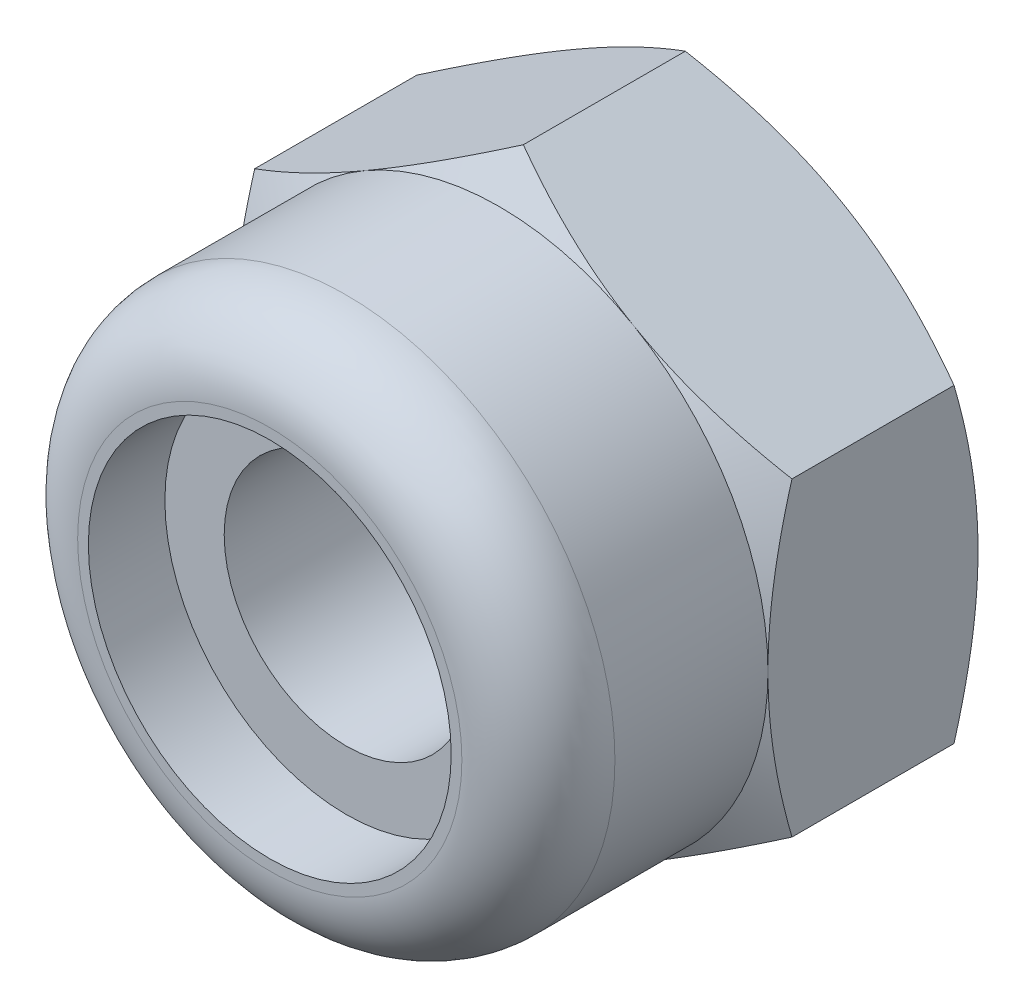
ISO-10303-21;
HEADER;
FILE_DESCRIPTION(('STEP AP214'),'2;1');
FILE_NAME('part.step','',(''),(''),'','','');
FILE_SCHEMA(('AUTOMOTIVE_DESIGN { 1 0 10303 214 1 1 1 1 }'));
ENDSEC;
DATA;
#1=APPLICATION_CONTEXT('core data for automotive mechanical design processes');
#2=APPLICATION_PROTOCOL_DEFINITION('international standard','automotive_design',2000,#1);
#3=PRODUCT_CONTEXT('',#1,'mechanical');
#4=PRODUCT('Part','Part','',(#3));
#5=PRODUCT_RELATED_PRODUCT_CATEGORY('part','',(#4));
#6=PRODUCT_DEFINITION_FORMATION('','',#4);
#7=PRODUCT_DEFINITION_CONTEXT('part definition',#1,'design');
#8=PRODUCT_DEFINITION('design','',#6,#7);
#9=PRODUCT_DEFINITION_SHAPE('','',#8);
#10=(LENGTH_UNIT() NAMED_UNIT(*) SI_UNIT(.MILLI.,.METRE.));
#11=(NAMED_UNIT(*) PLANE_ANGLE_UNIT() SI_UNIT($,.RADIAN.));
#12=(NAMED_UNIT(*) SI_UNIT($,.STERADIAN.) SOLID_ANGLE_UNIT());
#13=UNCERTAINTY_MEASURE_WITH_UNIT(LENGTH_MEASURE(1.E-05),#10,'distance_accuracy_value','');
#14=(GEOMETRIC_REPRESENTATION_CONTEXT(3) GLOBAL_UNCERTAINTY_ASSIGNED_CONTEXT((#13)) GLOBAL_UNIT_ASSIGNED_CONTEXT((#10,
#11,#12)) REPRESENTATION_CONTEXT('',''));
#15=CARTESIAN_POINT('',(0.,0.,0.));
#16=DIRECTION('',(0.,0.,1.));
#17=DIRECTION('',(1.,0.,0.));
#18=AXIS2_PLACEMENT_3D('',#15,#16,#17);
#19=CARTESIAN_POINT('',(0.,0.,-2.15));
#20=DIRECTION('',(0.,0.,1.));
#21=DIRECTION('',(1.,0.,0.));
#22=AXIS2_PLACEMENT_3D('',#19,#20,#21);
#23=CYLINDRICAL_SURFACE('',#22,1.25);
#24=CARTESIAN_POINT('',(0.,0.,1.56666666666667));
#25=DIRECTION('',(0.,0.,1.));
#26=DIRECTION('',(1.,0.,0.));
#27=AXIS2_PLACEMENT_3D('',#24,#25,#26);
#28=CIRCLE('',#27,1.25);
#29=CARTESIAN_POINT('',(1.25,0.,1.56666666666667));
#30=VERTEX_POINT('',#29);
#31=EDGE_CURVE('E281',#30,#30,#28,.T.);
#32=CARTESIAN_POINT('',(0.,0.,-1.94954811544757));
#33=DIRECTION('',(0.,0.,-1.));
#34=DIRECTION('',(-1.,0.,0.));
#35=AXIS2_PLACEMENT_3D('',#32,#33,#34);
#36=CIRCLE('',#35,1.25);
#37=CARTESIAN_POINT('',(1.25,0.,-1.94954811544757));
#38=VERTEX_POINT('',#37);
#39=EDGE_CURVE('E40',#38,#38,#36,.F.);
#40=CARTESIAN_POINT('',(1.25,0.,1.56666666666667));
#41=CARTESIAN_POINT('',(1.25,0.,1.53003942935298));
#42=CARTESIAN_POINT('',(1.25,0.,1.49341219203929));
#43=CARTESIAN_POINT('',(1.25,0.,1.42015771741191));
#44=CARTESIAN_POINT('',(1.25,0.,1.38353048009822));
#45=CARTESIAN_POINT('',(1.25,0.,1.31027600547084));
#46=CARTESIAN_POINT('',(1.25,0.,1.27364876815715));
#47=CARTESIAN_POINT('',(1.25,0.,1.20039429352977));
#48=CARTESIAN_POINT('',(1.25,0.,1.16376705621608));
#49=CARTESIAN_POINT('',(1.25,0.,1.0905125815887));
#50=CARTESIAN_POINT('',(1.25,0.,1.05388534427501));
#51=CARTESIAN_POINT('',(1.25,0.,0.980630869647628));
#52=CARTESIAN_POINT('',(1.25,0.,0.944003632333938));
#53=CARTESIAN_POINT('',(1.25,0.,0.870749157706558));
#54=CARTESIAN_POINT('',(1.25,0.,0.834121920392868));
#55=CARTESIAN_POINT('',(1.25,0.,0.760867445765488));
#56=CARTESIAN_POINT('',(1.25,0.,0.724240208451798));
#57=CARTESIAN_POINT('',(1.25,0.,0.650985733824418));
#58=CARTESIAN_POINT('',(1.25,0.,0.614358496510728));
#59=CARTESIAN_POINT('',(1.25,0.,0.541104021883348));
#60=CARTESIAN_POINT('',(1.25,0.,0.504476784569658));
#61=CARTESIAN_POINT('',(1.25,0.,0.431222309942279));
#62=CARTESIAN_POINT('',(1.25,0.,0.394595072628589));
#63=CARTESIAN_POINT('',(1.25,0.,0.321340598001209));
#64=CARTESIAN_POINT('',(1.25,0.,0.284713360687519));
#65=CARTESIAN_POINT('',(1.25,0.,0.211458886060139));
#66=CARTESIAN_POINT('',(1.25,0.,0.174831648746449));
#67=CARTESIAN_POINT('',(1.25,0.,0.101577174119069));
#68=CARTESIAN_POINT('',(1.25,0.,0.064949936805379));
#69=CARTESIAN_POINT('',(1.25,0.,-0.00830453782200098));
#70=CARTESIAN_POINT('',(1.25,0.,-0.0449317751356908));
#71=CARTESIAN_POINT('',(1.25,0.,-0.118186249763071));
#72=CARTESIAN_POINT('',(1.25,0.,-0.154813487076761));
#73=CARTESIAN_POINT('',(1.25,0.,-0.228067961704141));
#74=CARTESIAN_POINT('',(1.25,0.,-0.26469519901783));
#75=CARTESIAN_POINT('',(1.25,0.,-0.33794967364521));
#76=CARTESIAN_POINT('',(1.25,0.,-0.3745769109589));
#77=CARTESIAN_POINT('',(1.25,0.,-0.44783138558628));
#78=CARTESIAN_POINT('',(1.25,0.,-0.48445862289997));
#79=CARTESIAN_POINT('',(1.25,0.,-0.55771309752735));
#80=CARTESIAN_POINT('',(1.25,0.,-0.59434033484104));
#81=CARTESIAN_POINT('',(1.25,0.,-0.66759480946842));
#82=CARTESIAN_POINT('',(1.25,0.,-0.70422204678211));
#83=CARTESIAN_POINT('',(1.25,0.,-0.77747652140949));
#84=CARTESIAN_POINT('',(1.25,0.,-0.81410375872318));
#85=CARTESIAN_POINT('',(1.25,0.,-0.88735823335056));
#86=CARTESIAN_POINT('',(1.25,0.,-0.92398547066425));
#87=CARTESIAN_POINT('',(1.25,0.,-0.99723994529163));
#88=CARTESIAN_POINT('',(1.25,0.,-1.03386718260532));
#89=CARTESIAN_POINT('',(1.25,0.,-1.1071216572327));
#90=CARTESIAN_POINT('',(1.25,0.,-1.14374889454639));
#91=CARTESIAN_POINT('',(1.25,0.,-1.21700336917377));
#92=CARTESIAN_POINT('',(1.25,0.,-1.25363060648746));
#93=CARTESIAN_POINT('',(1.25,0.,-1.32688508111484));
#94=CARTESIAN_POINT('',(1.25,0.,-1.36351231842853));
#95=CARTESIAN_POINT('',(1.25,0.,-1.43676679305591));
#96=CARTESIAN_POINT('',(1.25,0.,-1.4733940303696));
#97=CARTESIAN_POINT('',(1.25,0.,-1.54664850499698));
#98=CARTESIAN_POINT('',(1.25,0.,-1.58327574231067));
#99=CARTESIAN_POINT('',(1.25,0.,-1.65653021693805));
#100=CARTESIAN_POINT('',(1.25,0.,-1.69315745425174));
#101=CARTESIAN_POINT('',(1.25,0.,-1.76641192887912));
#102=CARTESIAN_POINT('',(1.25,0.,-1.80303916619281));
#103=CARTESIAN_POINT('',(1.25,0.,-1.87629364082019));
#104=CARTESIAN_POINT('',(1.25,0.,-1.91292087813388));
#105=CARTESIAN_POINT('',(1.25,0.,-1.94954811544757));
#106=B_SPLINE_CURVE_WITH_KNOTS('',3,(#40,#41,#42,#43,#44,#45,#46,#47,#48,#49,#50,#51,#52,#53,
#54,#55,#56,#57,#58,#59,#60,#61,#62,#63,#64,#65,#66,#67,#68,#69,#70,#71,#72,#73,#74,#75,#76,#77,
#78,#79,#80,#81,#82,#83,#84,#85,#86,#87,#88,#89,#90,#91,#92,#93,#94,#95,#96,#97,#98,#99,#100,
#101,#102,#103,#104,#105),.UNSPECIFIED.,.F.,.F.,(4,2,2,2,2,2,2,2,2,2,2,2,2,2,2,2,2,2,2,2,2,2,2,
2,2,2,2,2,2,2,2,2,4),(0.,0.10988171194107,0.21976342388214,0.329645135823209,0.439526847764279,
0.549408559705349,0.659290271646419,0.769171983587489,0.879053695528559,0.988935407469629,
1.0988171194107,1.20869883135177,1.31858054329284,1.42846225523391,1.53834396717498,
1.64822567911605,1.75810739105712,1.86798910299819,1.97787081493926,2.08775252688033,
2.1976342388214,2.30751595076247,2.41739766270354,2.52727937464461,2.63716108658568,
2.74704279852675,2.85692451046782,2.96680622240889,3.07668793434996,3.18656964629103,
3.29645135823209,3.40633307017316,3.51621478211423),.UNSPECIFIED.);
#107=EDGE_CURVE('BSEAM35',#30,#38,#106,.T.);
#108=ORIENTED_EDGE('',*,*,#31,.T.);
#109=ORIENTED_EDGE('',*,*,#39,.F.);
#110=ORIENTED_EDGE('',*,*,#107,.T.);
#111=ORIENTED_EDGE('',*,*,#107,.F.);
#112=EDGE_LOOP('',(#108,#110,#109,#111));
#113=FACE_BOUND('',#112,.T.);
#114=ADVANCED_FACE('F35',(#113),#23,.F.);
#115=CARTESIAN_POINT('',(0.,3.17542648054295,-2.15));
#116=DIRECTION('',(-0.500000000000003,0.866025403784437,0.));
#117=DIRECTION('',(-0.866025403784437,-0.500000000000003,0.));
#118=AXIS2_PLACEMENT_3D('',#115,#116,#117);
#119=PLANE('',#118);
#120=DIRECTION('',(0.,0.,1.));
#121=VECTOR('',#120,1.);
#122=CARTESIAN_POINT('',(-2.75,1.58771324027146,-2.15));
#123=LINE('',#122,#121);
#124=CARTESIAN_POINT('',(-2.75,1.58771324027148,-1.90437990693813));
#125=VERTEX_POINT('',#124);
#126=CARTESIAN_POINT('',(-2.75,1.58771324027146,-0.245620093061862));
#127=VERTEX_POINT('',#126);
#128=EDGE_CURVE('E254',#125,#127,#123,.T.);
#129=ORIENTED_EDGE('',*,*,#128,.T.);
#130=CARTESIAN_POINT('',(-2.7502,1.58759777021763,-0.24568676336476));
#131=CARTESIAN_POINT('',(-2.62935077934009,1.65737010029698,-0.205387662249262));
#132=CARTESIAN_POINT('',(-2.50745839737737,1.72774469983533,-0.168736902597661));
#133=CARTESIAN_POINT('',(-2.26156287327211,1.86971254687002,-0.1047621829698));
#134=CARTESIAN_POINT('',(-2.13755536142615,1.94130831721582,-0.0774608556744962));
#135=CARTESIAN_POINT('',(-1.89107720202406,2.08361254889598,-0.0349617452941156));
#136=CARTESIAN_POINT('',(-1.76864448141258,2.15429911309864,-0.0194811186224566));
#137=CARTESIAN_POINT('',(-1.52320285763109,2.29600490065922,-0.00099939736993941));
#138=CARTESIAN_POINT('',(-1.40019484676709,2.36702360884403,0.0020170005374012));
#139=CARTESIAN_POINT('',(-1.17034121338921,2.49972966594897,-0.00425314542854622));
#140=CARTESIAN_POINT('',(-1.06346120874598,2.56143686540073,-0.0120001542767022));
#141=CARTESIAN_POINT('',(-0.850397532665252,2.68444923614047,-0.0365551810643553));
#142=CARTESIAN_POINT('',(-0.744214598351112,2.74575398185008,-0.0533715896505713));
#143=CARTESIAN_POINT('',(-0.530711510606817,2.86902004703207,-0.0954119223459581));
#144=CARTESIAN_POINT('',(-0.423418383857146,2.93096576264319,-0.120814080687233));
#145=CARTESIAN_POINT('',(-0.210432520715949,3.05393320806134,-0.178467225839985));
#146=CARTESIAN_POINT('',(-0.104737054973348,3.11495651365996,-0.210704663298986));
#147=CARTESIAN_POINT('',(0.000200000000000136,3.17554195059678,-0.245686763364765));
#148=B_SPLINE_CURVE_WITH_KNOTS('',3,(#130,#131,#132,#133,#134,#135,#136,#137,#138,#139,#140,
#141,#142,#143,#144,#145,#146,#147),.UNSPECIFIED.,.F.,.F.,(4,2,2,2,2,2,2,2,4),(0.,
0.435912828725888,0.872873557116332,1.29901931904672,1.72464171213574,2.09526089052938,
2.46622354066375,2.84541551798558,3.22386274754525),.UNSPECIFIED.);
#149=CARTESIAN_POINT('',(-1.37500000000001,2.3815698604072,0.));
#150=VERTEX_POINT('',#149);
#151=EDGE_CURVE('E60',#127,#150,#148,.T.);
#152=ORIENTED_EDGE('',*,*,#151,.T.);
#153=CARTESIAN_POINT('',(0.,3.17542648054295,-0.245620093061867));
#154=VERTEX_POINT('',#153);
#155=EDGE_CURVE('E203',#150,#154,#148,.T.);
#156=ORIENTED_EDGE('',*,*,#155,.T.);
#157=DIRECTION('',(0.,0.,1.));
#158=VECTOR('',#157,1.);
#159=CARTESIAN_POINT('',(0.,3.17542648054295,-2.15));
#160=LINE('',#159,#158);
#161=CARTESIAN_POINT('',(0.,3.17542648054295,-1.90437990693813));
#162=VERTEX_POINT('',#161);
#163=EDGE_CURVE('E240',#162,#154,#160,.T.);
#164=ORIENTED_EDGE('',*,*,#163,.F.);
#165=CARTESIAN_POINT('',(-2.7502,1.58759777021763,-1.90431323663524));
#166=CARTESIAN_POINT('',(-2.62935077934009,1.65737010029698,-1.94461233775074));
#167=CARTESIAN_POINT('',(-2.50745839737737,1.72774469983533,-1.98126309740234));
#168=CARTESIAN_POINT('',(-2.26156287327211,1.86971254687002,-2.0452378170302));
#169=CARTESIAN_POINT('',(-2.13755536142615,1.94130831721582,-2.0725391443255));
#170=CARTESIAN_POINT('',(-1.89107720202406,2.08361254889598,-2.11503825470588));
#171=CARTESIAN_POINT('',(-1.76864448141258,2.15429911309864,-2.13051888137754));
#172=CARTESIAN_POINT('',(-1.52320285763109,2.29600490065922,-2.14900060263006));
#173=CARTESIAN_POINT('',(-1.40019484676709,2.36702360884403,-2.1520170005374));
#174=CARTESIAN_POINT('',(-1.17034121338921,2.49972966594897,-2.14574685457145));
#175=CARTESIAN_POINT('',(-1.06346120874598,2.56143686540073,-2.1379998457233));
#176=CARTESIAN_POINT('',(-0.850397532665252,2.68444923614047,-2.11344481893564));
#177=CARTESIAN_POINT('',(-0.744214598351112,2.74575398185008,-2.09662841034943));
#178=CARTESIAN_POINT('',(-0.530711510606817,2.86902004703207,-2.05458807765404));
#179=CARTESIAN_POINT('',(-0.423418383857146,2.93096576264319,-2.02918591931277));
#180=CARTESIAN_POINT('',(-0.210432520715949,3.05393320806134,-1.97153277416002));
#181=CARTESIAN_POINT('',(-0.104737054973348,3.11495651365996,-1.93929533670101));
#182=CARTESIAN_POINT('',(0.000200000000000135,3.17554195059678,-1.90431323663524));
#183=B_SPLINE_CURVE_WITH_KNOTS('',3,(#165,#166,#167,#168,#169,#170,#171,#172,#173,#174,#175,
#176,#177,#178,#179,#180,#181,#182),.UNSPECIFIED.,.F.,.F.,(4,2,2,2,2,2,2,2,4),(0.,
0.435912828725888,0.872873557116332,1.29901931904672,1.72464171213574,2.09526089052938,
2.46622354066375,2.84541551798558,3.22386274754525),.UNSPECIFIED.);
#184=CARTESIAN_POINT('',(-1.37500000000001,2.3815698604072,-2.15));
#185=VERTEX_POINT('',#184);
#186=EDGE_CURVE('E256',#185,#162,#183,.T.);
#187=ORIENTED_EDGE('',*,*,#186,.F.);
#188=EDGE_CURVE('E234',#125,#185,#183,.T.);
#189=ORIENTED_EDGE('',*,*,#188,.F.);
#190=EDGE_LOOP('',(#129,#152,#156,#164,#187,#189));
#191=FACE_BOUND('',#190,.T.);
#192=ADVANCED_FACE('F37',(#191),#119,.T.);
#193=CARTESIAN_POINT('',(2.75,1.58771324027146,-2.15));
#194=DIRECTION('',(0.500000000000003,0.866025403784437,0.));
#195=DIRECTION('',(-0.866025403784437,0.500000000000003,0.));
#196=AXIS2_PLACEMENT_3D('',#193,#194,#195);
#197=PLANE('',#196);
#198=ORIENTED_EDGE('',*,*,#163,.T.);
#199=CARTESIAN_POINT('',(-0.000199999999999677,3.17554195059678,-0.245686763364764));
#200=CARTESIAN_POINT('',(0.120649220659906,3.10576962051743,-0.205387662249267));
#201=CARTESIAN_POINT('',(0.242541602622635,3.03539502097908,-0.168736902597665));
#202=CARTESIAN_POINT('',(0.488437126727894,2.89342717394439,-0.104762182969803));
#203=CARTESIAN_POINT('',(0.612444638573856,2.82183140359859,-0.0774608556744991));
#204=CARTESIAN_POINT('',(0.858922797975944,2.67952717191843,-0.0349617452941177));
#205=CARTESIAN_POINT('',(0.981355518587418,2.60884060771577,-0.0194811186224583));
#206=CARTESIAN_POINT('',(1.22679714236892,2.46713482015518,-0.00099939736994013));
#207=CARTESIAN_POINT('',(1.34980515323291,2.39611611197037,0.00201700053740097));
#208=CARTESIAN_POINT('',(1.57965878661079,2.26341005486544,-0.00425314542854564));
#209=CARTESIAN_POINT('',(1.68653879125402,2.20170285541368,-0.0120001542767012));
#210=CARTESIAN_POINT('',(1.89960246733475,2.07869048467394,-0.0365551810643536));
#211=CARTESIAN_POINT('',(2.00578540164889,2.01738573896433,-0.0533715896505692));
#212=CARTESIAN_POINT('',(2.21928848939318,1.89411967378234,-0.0954119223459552));
#213=CARTESIAN_POINT('',(2.32658161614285,1.83217395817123,-0.12081408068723));
#214=CARTESIAN_POINT('',(2.53956747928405,1.70920651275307,-0.178467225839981));
#215=CARTESIAN_POINT('',(2.64526294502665,1.64818320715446,-0.210704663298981));
#216=CARTESIAN_POINT('',(2.7502,1.58759777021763,-0.245686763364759));
#217=B_SPLINE_CURVE_WITH_KNOTS('',3,(#199,#200,#201,#202,#203,#204,#205,#206,#207,#208,#209,
#210,#211,#212,#213,#214,#215,#216),.UNSPECIFIED.,.F.,.F.,(4,2,2,2,2,2,2,2,4),(0.,
0.43591282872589,0.872873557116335,1.29901931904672,1.72464171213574,2.09526089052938,
2.46622354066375,2.84541551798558,3.22386274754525),.UNSPECIFIED.);
#218=CARTESIAN_POINT('',(1.37500000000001,2.3815698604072,0.));
#219=VERTEX_POINT('',#218);
#220=EDGE_CURVE('E212',#154,#219,#217,.T.);
#221=ORIENTED_EDGE('',*,*,#220,.T.);
#222=CARTESIAN_POINT('',(2.75,1.58771324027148,-0.245620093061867));
#223=VERTEX_POINT('',#222);
#224=EDGE_CURVE('E204',#219,#223,#217,.T.);
#225=ORIENTED_EDGE('',*,*,#224,.T.);
#226=DIRECTION('',(0.,0.,1.));
#227=VECTOR('',#226,1.);
#228=CARTESIAN_POINT('',(2.75,1.58771324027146,-2.15));
#229=LINE('',#228,#227);
#230=CARTESIAN_POINT('',(2.75,1.58771324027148,-1.90437990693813));
#231=VERTEX_POINT('',#230);
#232=EDGE_CURVE('E244',#231,#223,#229,.T.);
#233=ORIENTED_EDGE('',*,*,#232,.F.);
#234=CARTESIAN_POINT('',(-0.000199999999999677,3.17554195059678,-1.90431323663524));
#235=CARTESIAN_POINT('',(0.120649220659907,3.10576962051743,-1.94461233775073));
#236=CARTESIAN_POINT('',(0.242541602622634,3.03539502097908,-1.98126309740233));
#237=CARTESIAN_POINT('',(0.488437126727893,2.89342717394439,-2.0452378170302));
#238=CARTESIAN_POINT('',(0.612444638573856,2.82183140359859,-2.0725391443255));
#239=CARTESIAN_POINT('',(0.858922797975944,2.67952717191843,-2.11503825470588));
#240=CARTESIAN_POINT('',(0.981355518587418,2.60884060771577,-2.13051888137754));
#241=CARTESIAN_POINT('',(1.22679714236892,2.46713482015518,-2.14900060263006));
#242=CARTESIAN_POINT('',(1.34980515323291,2.39611611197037,-2.1520170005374));
#243=CARTESIAN_POINT('',(1.57965878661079,2.26341005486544,-2.14574685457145));
#244=CARTESIAN_POINT('',(1.68653879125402,2.20170285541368,-2.1379998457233));
#245=CARTESIAN_POINT('',(1.89960246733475,2.07869048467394,-2.11344481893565));
#246=CARTESIAN_POINT('',(2.00578540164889,2.01738573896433,-2.09662841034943));
#247=CARTESIAN_POINT('',(2.21928848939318,1.89411967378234,-2.05458807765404));
#248=CARTESIAN_POINT('',(2.32658161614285,1.83217395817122,-2.02918591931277));
#249=CARTESIAN_POINT('',(2.53956747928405,1.70920651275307,-1.97153277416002));
#250=CARTESIAN_POINT('',(2.64526294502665,1.64818320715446,-1.93929533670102));
#251=CARTESIAN_POINT('',(2.7502,1.58759777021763,-1.90431323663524));
#252=B_SPLINE_CURVE_WITH_KNOTS('',3,(#234,#235,#236,#237,#238,#239,#240,#241,#242,#243,#244,
#245,#246,#247,#248,#249,#250,#251),.UNSPECIFIED.,.F.,.F.,(4,2,2,2,2,2,2,2,4),(0.,
0.43591282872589,0.872873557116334,1.29901931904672,1.72464171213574,2.09526089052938,
2.46622354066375,2.84541551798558,3.22386274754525),.UNSPECIFIED.);
#253=CARTESIAN_POINT('',(1.37500000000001,2.3815698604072,-2.15));
#254=VERTEX_POINT('',#253);
#255=EDGE_CURVE('E225',#254,#231,#252,.T.);
#256=ORIENTED_EDGE('',*,*,#255,.F.);
#257=EDGE_CURVE('E232',#162,#254,#252,.T.);
#258=ORIENTED_EDGE('',*,*,#257,.F.);
#259=EDGE_LOOP('',(#198,#221,#225,#233,#256,#258));
#260=FACE_BOUND('',#259,.T.);
#261=ADVANCED_FACE('F215',(#260),#197,.T.);
#262=CARTESIAN_POINT('',(2.75,1.58771324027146,-2.15));
#263=DIRECTION('',(-1.,0.,0.));
#264=DIRECTION('',(0.,0.,1.));
#265=AXIS2_PLACEMENT_3D('',#262,#263,#264);
#266=PLANE('',#265);
#267=CARTESIAN_POINT('',(2.75,-4.21084949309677,-1.31594843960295));
#268=CARTESIAN_POINT('',(2.75,-4.09010894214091,-1.25759993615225));
#269=CARTESIAN_POINT('',(2.75,-3.9690829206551,-1.19983146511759));
#270=CARTESIAN_POINT('',(2.75,-3.72630558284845,-1.08578603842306));
#271=CARTESIAN_POINT('',(2.75,-3.60455414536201,-1.02950934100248));
#272=CARTESIAN_POINT('',(2.75,-3.35951393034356,-0.918482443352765));
#273=CARTESIAN_POINT('',(2.75,-3.23622034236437,-0.863742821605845));
#274=CARTESIAN_POINT('',(2.75,-2.98861980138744,-0.756614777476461));
#275=CARTESIAN_POINT('',(2.75,-2.86431290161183,-0.70422623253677));
#276=CARTESIAN_POINT('',(2.75,-2.61294485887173,-0.601803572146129));
#277=CARTESIAN_POINT('',(2.75,-2.48586863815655,-0.551806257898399));
#278=CARTESIAN_POINT('',(2.75,-2.23021732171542,-0.455727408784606));
#279=CARTESIAN_POINT('',(2.75,-2.10164206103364,-0.409646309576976));
#280=CARTESIAN_POINT('',(2.75,-1.84305218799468,-0.322638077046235));
#281=CARTESIAN_POINT('',(2.75,-1.71304130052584,-0.281699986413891));
#282=CARTESIAN_POINT('',(2.75,-1.45117125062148,-0.206307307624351));
#283=CARTESIAN_POINT('',(2.75,-1.31931268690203,-0.171850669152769));
#284=CARTESIAN_POINT('',(2.75,-1.05365722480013,-0.111093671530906));
#285=CARTESIAN_POINT('',(2.75,-0.919859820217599,-0.0847954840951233));
#286=CARTESIAN_POINT('',(2.75,-0.650651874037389,-0.0421260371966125));
#287=CARTESIAN_POINT('',(2.75,-0.515241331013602,-0.0257547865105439));
#288=CARTESIAN_POINT('',(2.75,-0.244373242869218,-0.00438749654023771));
#289=CARTESIAN_POINT('',(2.75,-0.10892152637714,0.000680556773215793));
#290=CARTESIAN_POINT('',(2.75,0.161887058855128,-0.000827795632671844));
#291=CARTESIAN_POINT('',(2.75,0.297243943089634,-0.00740117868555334));
#292=CARTESIAN_POINT('',(2.75,0.528385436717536,-0.0281041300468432));
#293=CARTESIAN_POINT('',(2.75,0.624425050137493,-0.0395376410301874));
#294=CARTESIAN_POINT('',(2.75,0.815762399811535,-0.0675217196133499));
#295=CARTESIAN_POINT('',(2.75,0.911060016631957,-0.084073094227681));
#296=CARTESIAN_POINT('',(2.75,1.19576218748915,-0.140535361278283));
#297=CARTESIAN_POINT('',(2.75,1.38383224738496,-0.187239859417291));
#298=CARTESIAN_POINT('',(2.75,1.66525048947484,-0.267792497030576));
#299=CARTESIAN_POINT('',(2.75,1.76006556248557,-0.296803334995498));
#300=CARTESIAN_POINT('',(2.75,1.94870609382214,-0.357695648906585));
#301=CARTESIAN_POINT('',(2.75,2.04253218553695,-0.3895751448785));
#302=CARTESIAN_POINT('',(2.75,2.22880240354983,-0.455541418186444));
#303=CARTESIAN_POINT('',(2.75,2.3212513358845,-0.489614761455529));
#304=CARTESIAN_POINT('',(2.75,2.50543192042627,-0.559761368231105));
#305=CARTESIAN_POINT('',(2.75,2.59716326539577,-0.595835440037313));
#306=CARTESIAN_POINT('',(2.75,2.68856293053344,-0.632712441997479));
#307=B_SPLINE_CURVE_WITH_KNOTS('',3,(#267,#268,#269,#270,#271,#272,#273,#274,#275,#276,#277,
#278,#279,#280,#281,#282,#283,#284,#285,#286,#287,#288,#289,#290,#291,#292,#293,#294,#295,#296,
#297,#298,#299,#300,#301,#302,#303,#304,#305,#306),.UNSPECIFIED.,.F.,.F.,(4,2,2,2,2,2,2,2,2,2,2,
2,2,2,2,2,2,2,2,4),(0.,0.402305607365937,0.804680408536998,1.20935783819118,1.61401414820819,
2.0236383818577,2.43330812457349,2.84208969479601,3.25074173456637,3.65950246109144,
4.06826354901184,4.47441284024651,4.88045669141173,5.17046846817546,5.46052599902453,
6.04107275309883,6.33851131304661,6.63574613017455,6.93130791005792,7.22698998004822),.UNSPECIFIED.);
#308=CARTESIAN_POINT('',(2.75,-1.58771324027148,-0.245620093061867));
#309=VERTEX_POINT('',#308);
#310=CARTESIAN_POINT('',(2.75,0.,0.));
#311=VERTEX_POINT('',#310);
#312=EDGE_CURVE('E191',#309,#311,#307,.T.);
#313=ORIENTED_EDGE('',*,*,#312,.F.);
#314=DIRECTION('',(0.,0.,1.));
#315=VECTOR('',#314,1.);
#316=CARTESIAN_POINT('',(2.75,-1.58771324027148,-2.15));
#317=LINE('',#316,#315);
#318=CARTESIAN_POINT('',(2.75,-1.58771324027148,-1.90437990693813));
#319=VERTEX_POINT('',#318);
#320=EDGE_CURVE('E247',#319,#309,#317,.T.);
#321=ORIENTED_EDGE('',*,*,#320,.F.);
#322=CARTESIAN_POINT('',(2.75,-4.21084949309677,-0.834051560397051));
#323=CARTESIAN_POINT('',(2.75,-4.09010894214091,-0.892400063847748));
#324=CARTESIAN_POINT('',(2.75,-3.9690829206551,-0.950168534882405));
#325=CARTESIAN_POINT('',(2.75,-3.72630558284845,-1.06421396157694));
#326=CARTESIAN_POINT('',(2.75,-3.60455414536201,-1.12049065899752));
#327=CARTESIAN_POINT('',(2.75,-3.35951393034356,-1.23151755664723));
#328=CARTESIAN_POINT('',(2.75,-3.23622034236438,-1.28625717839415));
#329=CARTESIAN_POINT('',(2.75,-2.98861980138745,-1.39338522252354));
#330=CARTESIAN_POINT('',(2.75,-2.86431290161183,-1.44577376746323));
#331=CARTESIAN_POINT('',(2.75,-2.61294485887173,-1.54819642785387));
#332=CARTESIAN_POINT('',(2.75,-2.48586863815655,-1.5981937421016));
#333=CARTESIAN_POINT('',(2.75,-2.23021732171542,-1.69427259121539));
#334=CARTESIAN_POINT('',(2.75,-2.10164206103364,-1.74035369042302));
#335=CARTESIAN_POINT('',(2.75,-1.84305218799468,-1.82736192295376));
#336=CARTESIAN_POINT('',(2.75,-1.71304130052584,-1.86830001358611));
#337=CARTESIAN_POINT('',(2.75,-1.45117125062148,-1.94369269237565));
#338=CARTESIAN_POINT('',(2.75,-1.31931268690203,-1.97814933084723));
#339=CARTESIAN_POINT('',(2.75,-1.05365722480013,-2.03890632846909));
#340=CARTESIAN_POINT('',(2.75,-0.919859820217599,-2.06520451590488));
#341=CARTESIAN_POINT('',(2.75,-0.650651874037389,-2.10787396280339));
#342=CARTESIAN_POINT('',(2.75,-0.515241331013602,-2.12424521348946));
#343=CARTESIAN_POINT('',(2.75,-0.244373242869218,-2.14561250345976));
#344=CARTESIAN_POINT('',(2.75,-0.10892152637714,-2.15068055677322));
#345=CARTESIAN_POINT('',(2.75,0.161887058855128,-2.14917220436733));
#346=CARTESIAN_POINT('',(2.75,0.297243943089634,-2.14259882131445));
#347=CARTESIAN_POINT('',(2.75,0.528385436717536,-2.12189586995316));
#348=CARTESIAN_POINT('',(2.75,0.624425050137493,-2.11046235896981));
#349=CARTESIAN_POINT('',(2.75,0.815762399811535,-2.08247828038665));
#350=CARTESIAN_POINT('',(2.75,0.911060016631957,-2.06592690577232));
#351=CARTESIAN_POINT('',(2.75,1.19576218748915,-2.00946463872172));
#352=CARTESIAN_POINT('',(2.75,1.38383224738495,-1.96276014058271));
#353=CARTESIAN_POINT('',(2.75,1.66525048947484,-1.88220750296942));
#354=CARTESIAN_POINT('',(2.75,1.76006556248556,-1.8531966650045));
#355=CARTESIAN_POINT('',(2.75,1.94870609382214,-1.79230435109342));
#356=CARTESIAN_POINT('',(2.75,2.04253218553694,-1.7604248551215));
#357=CARTESIAN_POINT('',(2.75,2.22880240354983,-1.69445858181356));
#358=CARTESIAN_POINT('',(2.75,2.3212513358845,-1.66038523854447));
#359=CARTESIAN_POINT('',(2.75,2.50543192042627,-1.5902386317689));
#360=CARTESIAN_POINT('',(2.75,2.59716326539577,-1.55416455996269));
#361=CARTESIAN_POINT('',(2.75,2.68856293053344,-1.51728755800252));
#362=B_SPLINE_CURVE_WITH_KNOTS('',3,(#322,#323,#324,#325,#326,#327,#328,#329,#330,#331,#332,
#333,#334,#335,#336,#337,#338,#339,#340,#341,#342,#343,#344,#345,#346,#347,#348,#349,#350,#351,
#352,#353,#354,#355,#356,#357,#358,#359,#360,#361),.UNSPECIFIED.,.F.,.F.,(4,2,2,2,2,2,2,2,2,2,2,
2,2,2,2,2,2,2,2,4),(0.,0.402305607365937,0.804680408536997,1.20935783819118,1.61401414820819,
2.0236383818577,2.43330812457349,2.84208969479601,3.25074173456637,3.65950246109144,
4.06826354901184,4.47441284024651,4.88045669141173,5.17046846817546,5.46052599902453,
6.04107275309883,6.33851131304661,6.63574613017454,6.93130791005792,7.22698998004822),.UNSPECIFIED.);
#363=CARTESIAN_POINT('',(2.75,0.,-2.15));
#364=VERTEX_POINT('',#363);
#365=EDGE_CURVE('E372',#319,#364,#362,.T.);
#366=ORIENTED_EDGE('',*,*,#365,.T.);
#367=EDGE_CURVE('E233',#364,#231,#362,.T.);
#368=ORIENTED_EDGE('',*,*,#367,.T.);
#369=ORIENTED_EDGE('',*,*,#232,.T.);
#370=EDGE_CURVE('E202',#311,#223,#307,.T.);
#371=ORIENTED_EDGE('',*,*,#370,.F.);
#372=EDGE_LOOP('',(#313,#321,#366,#368,#369,#371));
#373=FACE_BOUND('',#372,.T.);
#374=ADVANCED_FACE('F219',(#373),#266,.F.);
#375=CARTESIAN_POINT('',(0.,-3.17542648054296,-2.15));
#376=DIRECTION('',(0.500000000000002,-0.866025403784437,0.));
#377=DIRECTION('',(0.866025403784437,0.500000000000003,0.));
#378=AXIS2_PLACEMENT_3D('',#375,#376,#377);
#379=PLANE('',#378);
#380=ORIENTED_EDGE('',*,*,#320,.T.);
#381=CARTESIAN_POINT('',(2.7502,-1.58759777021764,-0.245686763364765));
#382=CARTESIAN_POINT('',(2.62935077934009,-1.657370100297,-0.205387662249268));
#383=CARTESIAN_POINT('',(2.50745839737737,-1.72774469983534,-0.168736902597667));
#384=CARTESIAN_POINT('',(2.26156287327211,-1.86971254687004,-0.104762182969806));
#385=CARTESIAN_POINT('',(2.13755536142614,-1.94130831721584,-0.0774608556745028));
#386=CARTESIAN_POINT('',(1.89107720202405,-2.08361254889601,-0.034961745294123));
#387=CARTESIAN_POINT('',(1.76864448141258,-2.15429911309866,-0.0194811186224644));
#388=CARTESIAN_POINT('',(1.52320285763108,-2.29600490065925,-0.00099939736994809));
#389=CARTESIAN_POINT('',(1.40019484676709,-2.36702360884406,0.00201700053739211));
#390=CARTESIAN_POINT('',(1.1703412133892,-2.49972966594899,-0.00425314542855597));
#391=CARTESIAN_POINT('',(1.06346120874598,-2.56143686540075,-0.0120001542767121));
#392=CARTESIAN_POINT('',(0.850397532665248,-2.68444923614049,-0.0365551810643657));
#393=CARTESIAN_POINT('',(0.744214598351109,-2.7457539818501,-0.0533715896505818));
#394=CARTESIAN_POINT('',(0.530711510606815,-2.86902004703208,-0.0954119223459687));
#395=CARTESIAN_POINT('',(0.423418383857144,-2.9309657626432,-0.120814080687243));
#396=CARTESIAN_POINT('',(0.210432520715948,-3.05393320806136,-0.178467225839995));
#397=CARTESIAN_POINT('',(0.104737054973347,-3.11495651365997,-0.210704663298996));
#398=CARTESIAN_POINT('',(-0.000200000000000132,-3.1755419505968,-0.245686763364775));
#399=B_SPLINE_CURVE_WITH_KNOTS('',3,(#381,#382,#383,#384,#385,#386,#387,#388,#389,#390,#391,
#392,#393,#394,#395,#396,#397,#398),.UNSPECIFIED.,.F.,.F.,(4,2,2,2,2,2,2,2,4),(0.,
0.435912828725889,0.872873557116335,1.29901931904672,1.72464171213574,2.09526089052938,
2.46622354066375,2.84541551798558,3.22386274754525),.UNSPECIFIED.);
#400=CARTESIAN_POINT('',(1.37500000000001,-2.3815698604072,0.));
#401=VERTEX_POINT('',#400);
#402=EDGE_CURVE('E366',#309,#401,#399,.T.);
#403=ORIENTED_EDGE('',*,*,#402,.T.);
#404=CARTESIAN_POINT('',(0.,-3.17542648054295,-0.245620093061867));
#405=VERTEX_POINT('',#404);
#406=EDGE_CURVE('E184',#401,#405,#399,.T.);
#407=ORIENTED_EDGE('',*,*,#406,.T.);
#408=DIRECTION('',(0.,0.,1.));
#409=VECTOR('',#408,1.);
#410=CARTESIAN_POINT('',(0.,-3.17542648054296,-2.15));
#411=LINE('',#410,#409);
#412=CARTESIAN_POINT('',(0.,-3.17542648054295,-1.90437990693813));
#413=VERTEX_POINT('',#412);
#414=EDGE_CURVE('E250',#413,#405,#411,.T.);
#415=ORIENTED_EDGE('',*,*,#414,.F.);
#416=CARTESIAN_POINT('',(2.7502,-1.58759777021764,-1.90431323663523));
#417=CARTESIAN_POINT('',(2.62935077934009,-1.657370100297,-1.94461233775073));
#418=CARTESIAN_POINT('',(2.50745839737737,-1.72774469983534,-1.98126309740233));
#419=CARTESIAN_POINT('',(2.26156287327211,-1.86971254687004,-2.04523781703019));
#420=CARTESIAN_POINT('',(2.13755536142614,-1.94130831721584,-2.0725391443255));
#421=CARTESIAN_POINT('',(1.89107720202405,-2.083612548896,-2.11503825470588));
#422=CARTESIAN_POINT('',(1.76864448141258,-2.15429911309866,-2.13051888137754));
#423=CARTESIAN_POINT('',(1.52320285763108,-2.29600490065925,-2.14900060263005));
#424=CARTESIAN_POINT('',(1.40019484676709,-2.36702360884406,-2.15201700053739));
#425=CARTESIAN_POINT('',(1.1703412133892,-2.49972966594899,-2.14574685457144));
#426=CARTESIAN_POINT('',(1.06346120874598,-2.56143686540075,-2.13799984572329));
#427=CARTESIAN_POINT('',(0.850397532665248,-2.68444923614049,-2.11344481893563));
#428=CARTESIAN_POINT('',(0.744214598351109,-2.7457539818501,-2.09662841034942));
#429=CARTESIAN_POINT('',(0.530711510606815,-2.86902004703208,-2.05458807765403));
#430=CARTESIAN_POINT('',(0.423418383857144,-2.9309657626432,-2.02918591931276));
#431=CARTESIAN_POINT('',(0.210432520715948,-3.05393320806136,-1.97153277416));
#432=CARTESIAN_POINT('',(0.104737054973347,-3.11495651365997,-1.939295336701));
#433=CARTESIAN_POINT('',(-0.000200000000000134,-3.1755419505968,-1.90431323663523));
#434=B_SPLINE_CURVE_WITH_KNOTS('',3,(#416,#417,#418,#419,#420,#421,#422,#423,#424,#425,#426,
#427,#428,#429,#430,#431,#432,#433),.UNSPECIFIED.,.F.,.F.,(4,2,2,2,2,2,2,2,4),(0.,
0.435912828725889,0.872873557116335,1.29901931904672,1.72464171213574,2.09526089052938,
2.46622354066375,2.84541551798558,3.22386274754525),.UNSPECIFIED.);
#435=CARTESIAN_POINT('',(1.37500000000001,-2.3815698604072,-2.15));
#436=VERTEX_POINT('',#435);
#437=EDGE_CURVE('E343',#436,#413,#434,.T.);
#438=ORIENTED_EDGE('',*,*,#437,.F.);
#439=EDGE_CURVE('E368',#319,#436,#434,.T.);
#440=ORIENTED_EDGE('',*,*,#439,.F.);
#441=EDGE_LOOP('',(#380,#403,#407,#415,#438,#440));
#442=FACE_BOUND('',#441,.T.);
#443=ADVANCED_FACE('F351',(#442),#379,.T.);
#444=CARTESIAN_POINT('',(-2.75,-1.58771324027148,-2.15));
#445=DIRECTION('',(-0.500000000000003,-0.866025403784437,0.));
#446=DIRECTION('',(0.866025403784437,-0.500000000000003,0.));
#447=AXIS2_PLACEMENT_3D('',#444,#445,#446);
#448=PLANE('',#447);
#449=ORIENTED_EDGE('',*,*,#414,.T.);
#450=CARTESIAN_POINT('',(0.00019999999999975,-3.1755419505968,-0.245686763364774));
#451=CARTESIAN_POINT('',(-0.120649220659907,-3.10576962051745,-0.205387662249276));
#452=CARTESIAN_POINT('',(-0.242541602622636,-3.0353950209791,-0.168736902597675));
#453=CARTESIAN_POINT('',(-0.488437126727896,-2.8934271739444,-0.104762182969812));
#454=CARTESIAN_POINT('',(-0.612444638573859,-2.8218314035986,-0.0774608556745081));
#455=CARTESIAN_POINT('',(-0.858922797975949,-2.67952717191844,-0.0349617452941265));
#456=CARTESIAN_POINT('',(-0.981355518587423,-2.60884060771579,-0.0194811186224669));
#457=CARTESIAN_POINT('',(-1.22679714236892,-2.4671348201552,-0.000999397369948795));
#458=CARTESIAN_POINT('',(-1.34980515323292,-2.39611611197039,0.00201700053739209));
#459=CARTESIAN_POINT('',(-1.5796587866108,-2.26341005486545,-0.00425314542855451));
#460=CARTESIAN_POINT('',(-1.68653879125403,-2.2017028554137,-0.0120001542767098));
#461=CARTESIAN_POINT('',(-1.89960246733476,-2.07869048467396,-0.0365551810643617));
#462=CARTESIAN_POINT('',(-2.00578540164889,-2.01738573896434,-0.0533715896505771));
#463=CARTESIAN_POINT('',(-2.21928848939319,-1.89411967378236,-0.0954119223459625));
#464=CARTESIAN_POINT('',(-2.32658161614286,-1.83217395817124,-0.120814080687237));
#465=CARTESIAN_POINT('',(-2.53956747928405,-1.70920651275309,-0.178467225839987));
#466=CARTESIAN_POINT('',(-2.64526294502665,-1.64818320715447,-0.210704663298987));
#467=CARTESIAN_POINT('',(-2.7502,-1.58759777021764,-0.245686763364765));
#468=B_SPLINE_CURVE_WITH_KNOTS('',3,(#450,#451,#452,#453,#454,#455,#456,#457,#458,#459,#460,
#461,#462,#463,#464,#465,#466,#467),.UNSPECIFIED.,.F.,.F.,(4,2,2,2,2,2,2,2,4),(0.,
0.435912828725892,0.872873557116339,1.29901931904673,1.72464171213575,2.09526089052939,
2.46622354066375,2.84541551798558,3.22386274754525),.UNSPECIFIED.);
#469=CARTESIAN_POINT('',(-1.37500000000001,-2.3815698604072,0.));
#470=VERTEX_POINT('',#469);
#471=EDGE_CURVE('E151',#405,#470,#468,.T.);
#472=ORIENTED_EDGE('',*,*,#471,.T.);
#473=CARTESIAN_POINT('',(-2.75,-1.58771324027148,-0.245620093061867));
#474=VERTEX_POINT('',#473);
#475=EDGE_CURVE('E142',#470,#474,#468,.T.);
#476=ORIENTED_EDGE('',*,*,#475,.T.);
#477=DIRECTION('',(0.,0.,1.));
#478=VECTOR('',#477,1.);
#479=CARTESIAN_POINT('',(-2.75,-1.58771324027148,-2.15));
#480=LINE('',#479,#478);
#481=CARTESIAN_POINT('',(-2.75,-1.58771324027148,-1.90437990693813));
#482=VERTEX_POINT('',#481);
#483=EDGE_CURVE('E150',#482,#474,#480,.T.);
#484=ORIENTED_EDGE('',*,*,#483,.F.);
#485=CARTESIAN_POINT('',(0.00019999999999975,-3.1755419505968,-1.90431323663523));
#486=CARTESIAN_POINT('',(-0.120649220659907,-3.10576962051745,-1.94461233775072));
#487=CARTESIAN_POINT('',(-0.242541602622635,-3.0353950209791,-1.98126309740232));
#488=CARTESIAN_POINT('',(-0.488437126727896,-2.8934271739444,-2.04523781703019));
#489=CARTESIAN_POINT('',(-0.612444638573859,-2.8218314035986,-2.07253914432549));
#490=CARTESIAN_POINT('',(-0.858922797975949,-2.67952717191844,-2.11503825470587));
#491=CARTESIAN_POINT('',(-0.981355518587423,-2.60884060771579,-2.13051888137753));
#492=CARTESIAN_POINT('',(-1.22679714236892,-2.4671348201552,-2.14900060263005));
#493=CARTESIAN_POINT('',(-1.34980515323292,-2.39611611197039,-2.15201700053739));
#494=CARTESIAN_POINT('',(-1.5796587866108,-2.26341005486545,-2.14574685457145));
#495=CARTESIAN_POINT('',(-1.68653879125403,-2.2017028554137,-2.13799984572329));
#496=CARTESIAN_POINT('',(-1.89960246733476,-2.07869048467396,-2.11344481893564));
#497=CARTESIAN_POINT('',(-2.00578540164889,-2.01738573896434,-2.09662841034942));
#498=CARTESIAN_POINT('',(-2.21928848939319,-1.89411967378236,-2.05458807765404));
#499=CARTESIAN_POINT('',(-2.32658161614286,-1.83217395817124,-2.02918591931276));
#500=CARTESIAN_POINT('',(-2.53956747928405,-1.70920651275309,-1.97153277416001));
#501=CARTESIAN_POINT('',(-2.64526294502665,-1.64818320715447,-1.93929533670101));
#502=CARTESIAN_POINT('',(-2.7502,-1.58759777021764,-1.90431323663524));
#503=B_SPLINE_CURVE_WITH_KNOTS('',3,(#485,#486,#487,#488,#489,#490,#491,#492,#493,#494,#495,
#496,#497,#498,#499,#500,#501,#502),.UNSPECIFIED.,.F.,.F.,(4,2,2,2,2,2,2,2,4),(0.,
0.435912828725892,0.872873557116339,1.29901931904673,1.72464171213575,2.09526089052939,
2.46622354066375,2.84541551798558,3.22386274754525),.UNSPECIFIED.);
#504=CARTESIAN_POINT('',(-1.37500000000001,-2.3815698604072,-2.15));
#505=VERTEX_POINT('',#504);
#506=EDGE_CURVE('E330',#505,#482,#503,.T.);
#507=ORIENTED_EDGE('',*,*,#506,.F.);
#508=EDGE_CURVE('E342',#413,#505,#503,.T.);
#509=ORIENTED_EDGE('',*,*,#508,.F.);
#510=EDGE_LOOP('',(#449,#472,#476,#484,#507,#509));
#511=FACE_BOUND('',#510,.T.);
#512=ADVANCED_FACE('F348',(#511),#448,.T.);
#513=CARTESIAN_POINT('',(-2.75,1.58771324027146,-2.15));
#514=DIRECTION('',(-1.,0.,0.));
#515=DIRECTION('',(0.,0.,1.));
#516=AXIS2_PLACEMENT_3D('',#513,#514,#515);
#517=PLANE('',#516);
#518=ORIENTED_EDGE('',*,*,#483,.T.);
#519=CARTESIAN_POINT('',(-2.75,-4.21084949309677,-1.31594843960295));
#520=CARTESIAN_POINT('',(-2.75,-4.09010894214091,-1.25759993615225));
#521=CARTESIAN_POINT('',(-2.75,-3.9690829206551,-1.19983146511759));
#522=CARTESIAN_POINT('',(-2.75,-3.72630558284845,-1.08578603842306));
#523=CARTESIAN_POINT('',(-2.75,-3.60455414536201,-1.02950934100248));
#524=CARTESIAN_POINT('',(-2.75,-3.35951393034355,-0.918482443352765));
#525=CARTESIAN_POINT('',(-2.75,-3.23622034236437,-0.863742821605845));
#526=CARTESIAN_POINT('',(-2.75,-2.98861980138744,-0.75661477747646));
#527=CARTESIAN_POINT('',(-2.75,-2.86431290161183,-0.70422623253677));
#528=CARTESIAN_POINT('',(-2.75,-2.61294485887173,-0.601803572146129));
#529=CARTESIAN_POINT('',(-2.75,-2.48586863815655,-0.551806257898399));
#530=CARTESIAN_POINT('',(-2.75,-2.23021732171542,-0.455727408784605));
#531=CARTESIAN_POINT('',(-2.75,-2.10164206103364,-0.409646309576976));
#532=CARTESIAN_POINT('',(-2.75,-1.84305218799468,-0.322638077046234));
#533=CARTESIAN_POINT('',(-2.75,-1.71304130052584,-0.281699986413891));
#534=CARTESIAN_POINT('',(-2.75,-1.45117125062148,-0.206307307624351));
#535=CARTESIAN_POINT('',(-2.75,-1.31931268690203,-0.171850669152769));
#536=CARTESIAN_POINT('',(-2.75,-1.05365722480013,-0.111093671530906));
#537=CARTESIAN_POINT('',(-2.75,-0.919859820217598,-0.084795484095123));
#538=CARTESIAN_POINT('',(-2.75,-0.650651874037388,-0.0421260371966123));
#539=CARTESIAN_POINT('',(-2.75,-0.515241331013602,-0.0257547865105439));
#540=CARTESIAN_POINT('',(-2.75,-0.244373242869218,-0.00438749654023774));
#541=CARTESIAN_POINT('',(-2.75,-0.10892152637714,0.000680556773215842));
#542=CARTESIAN_POINT('',(-2.75,0.161887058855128,-0.000827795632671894));
#543=CARTESIAN_POINT('',(-2.75,0.297243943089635,-0.00740117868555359));
#544=CARTESIAN_POINT('',(-2.75,0.528385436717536,-0.0281041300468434));
#545=CARTESIAN_POINT('',(-2.75,0.624425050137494,-0.0395376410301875));
#546=CARTESIAN_POINT('',(-2.75,0.815762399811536,-0.0675217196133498));
#547=CARTESIAN_POINT('',(-2.75,0.911060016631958,-0.0840730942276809));
#548=CARTESIAN_POINT('',(-2.75,1.19576218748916,-0.140535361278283));
#549=CARTESIAN_POINT('',(-2.75,1.38383224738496,-0.187239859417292));
#550=CARTESIAN_POINT('',(-2.75,1.66525048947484,-0.267792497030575));
#551=CARTESIAN_POINT('',(-2.75,1.76006556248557,-0.296803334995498));
#552=CARTESIAN_POINT('',(-2.75,1.94870609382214,-0.357695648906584));
#553=CARTESIAN_POINT('',(-2.75,2.04253218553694,-0.3895751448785));
#554=CARTESIAN_POINT('',(-2.75,2.22880240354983,-0.455541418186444));
#555=CARTESIAN_POINT('',(-2.75,2.3212513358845,-0.489614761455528));
#556=CARTESIAN_POINT('',(-2.75,2.50543192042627,-0.559761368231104));
#557=CARTESIAN_POINT('',(-2.75,2.59716326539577,-0.595835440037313));
#558=CARTESIAN_POINT('',(-2.75,2.68856293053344,-0.632712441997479));
#559=B_SPLINE_CURVE_WITH_KNOTS('',3,(#519,#520,#521,#522,#523,#524,#525,#526,#527,#528,#529,
#530,#531,#532,#533,#534,#535,#536,#537,#538,#539,#540,#541,#542,#543,#544,#545,#546,#547,#548,
#549,#550,#551,#552,#553,#554,#555,#556,#557,#558),.UNSPECIFIED.,.F.,.F.,(4,2,2,2,2,2,2,2,2,2,2,
2,2,2,2,2,2,2,2,4),(0.,0.402305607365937,0.804680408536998,1.20935783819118,1.61401414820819,
2.0236383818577,2.43330812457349,2.84208969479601,3.25074173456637,3.65950246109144,
4.06826354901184,4.47441284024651,4.88045669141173,5.17046846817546,5.46052599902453,
6.04107275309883,6.33851131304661,6.63574613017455,6.93130791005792,7.22698998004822),.UNSPECIFIED.);
#560=CARTESIAN_POINT('',(-2.75,0.,0.));
#561=VERTEX_POINT('',#560);
#562=EDGE_CURVE('E135',#474,#561,#559,.T.);
#563=ORIENTED_EDGE('',*,*,#562,.T.);
#564=EDGE_CURVE('E129',#561,#127,#559,.T.);
#565=ORIENTED_EDGE('',*,*,#564,.T.);
#566=ORIENTED_EDGE('',*,*,#128,.F.);
#567=CARTESIAN_POINT('',(-2.75,-4.21084949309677,-0.834051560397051));
#568=CARTESIAN_POINT('',(-2.75,-4.09010894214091,-0.892400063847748));
#569=CARTESIAN_POINT('',(-2.75,-3.9690829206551,-0.950168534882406));
#570=CARTESIAN_POINT('',(-2.75,-3.72630558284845,-1.06421396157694));
#571=CARTESIAN_POINT('',(-2.75,-3.60455414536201,-1.12049065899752));
#572=CARTESIAN_POINT('',(-2.75,-3.35951393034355,-1.23151755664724));
#573=CARTESIAN_POINT('',(-2.75,-3.23622034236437,-1.28625717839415));
#574=CARTESIAN_POINT('',(-2.75,-2.98861980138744,-1.39338522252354));
#575=CARTESIAN_POINT('',(-2.75,-2.86431290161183,-1.44577376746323));
#576=CARTESIAN_POINT('',(-2.75,-2.61294485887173,-1.54819642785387));
#577=CARTESIAN_POINT('',(-2.75,-2.48586863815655,-1.5981937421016));
#578=CARTESIAN_POINT('',(-2.75,-2.23021732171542,-1.69427259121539));
#579=CARTESIAN_POINT('',(-2.75,-2.10164206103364,-1.74035369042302));
#580=CARTESIAN_POINT('',(-2.75,-1.84305218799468,-1.82736192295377));
#581=CARTESIAN_POINT('',(-2.75,-1.71304130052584,-1.86830001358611));
#582=CARTESIAN_POINT('',(-2.75,-1.45117125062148,-1.94369269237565));
#583=CARTESIAN_POINT('',(-2.75,-1.31931268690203,-1.97814933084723));
#584=CARTESIAN_POINT('',(-2.75,-1.05365722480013,-2.03890632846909));
#585=CARTESIAN_POINT('',(-2.75,-0.919859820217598,-2.06520451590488));
#586=CARTESIAN_POINT('',(-2.75,-0.650651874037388,-2.10787396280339));
#587=CARTESIAN_POINT('',(-2.75,-0.515241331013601,-2.12424521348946));
#588=CARTESIAN_POINT('',(-2.75,-0.244373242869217,-2.14561250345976));
#589=CARTESIAN_POINT('',(-2.75,-0.108921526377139,-2.15068055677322));
#590=CARTESIAN_POINT('',(-2.75,0.161887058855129,-2.14917220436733));
#591=CARTESIAN_POINT('',(-2.75,0.297243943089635,-2.14259882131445));
#592=CARTESIAN_POINT('',(-2.75,0.528385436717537,-2.12189586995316));
#593=CARTESIAN_POINT('',(-2.75,0.624425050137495,-2.11046235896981));
#594=CARTESIAN_POINT('',(-2.75,0.815762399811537,-2.08247828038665));
#595=CARTESIAN_POINT('',(-2.75,0.911060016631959,-2.06592690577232));
#596=CARTESIAN_POINT('',(-2.75,1.19576218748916,-2.00946463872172));
#597=CARTESIAN_POINT('',(-2.75,1.38383224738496,-1.96276014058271));
#598=CARTESIAN_POINT('',(-2.75,1.66525048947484,-1.88220750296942));
#599=CARTESIAN_POINT('',(-2.75,1.76006556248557,-1.8531966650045));
#600=CARTESIAN_POINT('',(-2.75,1.94870609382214,-1.79230435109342));
#601=CARTESIAN_POINT('',(-2.75,2.04253218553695,-1.7604248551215));
#602=CARTESIAN_POINT('',(-2.75,2.22880240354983,-1.69445858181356));
#603=CARTESIAN_POINT('',(-2.75,2.3212513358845,-1.66038523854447));
#604=CARTESIAN_POINT('',(-2.75,2.50543192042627,-1.5902386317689));
#605=CARTESIAN_POINT('',(-2.75,2.59716326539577,-1.55416455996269));
#606=CARTESIAN_POINT('',(-2.75,2.68856293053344,-1.51728755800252));
#607=B_SPLINE_CURVE_WITH_KNOTS('',3,(#567,#568,#569,#570,#571,#572,#573,#574,#575,#576,#577,
#578,#579,#580,#581,#582,#583,#584,#585,#586,#587,#588,#589,#590,#591,#592,#593,#594,#595,#596,
#597,#598,#599,#600,#601,#602,#603,#604,#605,#606),.UNSPECIFIED.,.F.,.F.,(4,2,2,2,2,2,2,2,2,2,2,
2,2,2,2,2,2,2,2,4),(0.,0.402305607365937,0.804680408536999,1.20935783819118,1.61401414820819,
2.0236383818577,2.43330812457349,2.84208969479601,3.25074173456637,3.65950246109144,
4.06826354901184,4.47441284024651,4.88045669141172,5.17046846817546,5.46052599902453,
6.04107275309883,6.33851131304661,6.63574613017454,6.93130791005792,7.22698998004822),.UNSPECIFIED.);
#608=CARTESIAN_POINT('',(-2.75,0.,-2.15));
#609=VERTEX_POINT('',#608);
#610=EDGE_CURVE('E326',#609,#125,#607,.T.);
#611=ORIENTED_EDGE('',*,*,#610,.F.);
#612=EDGE_CURVE('E328',#482,#609,#607,.T.);
#613=ORIENTED_EDGE('',*,*,#612,.F.);
#614=EDGE_LOOP('',(#518,#563,#565,#566,#611,#613));
#615=FACE_BOUND('',#614,.T.);
#616=ADVANCED_FACE('F147',(#615),#517,.T.);
#617=CARTESIAN_POINT('',(0.,3.17542648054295,-2.15));
#618=DIRECTION('',(0.,0.,-1.));
#619=DIRECTION('',(-1.,0.,0.));
#620=AXIS2_PLACEMENT_3D('',#617,#618,#619);
#621=PLANE('',#620);
#622=CARTESIAN_POINT('',(0.,0.,-2.15));
#623=DIRECTION('',(0.,0.,-1.));
#624=DIRECTION('',(-1.,0.,0.));
#625=AXIS2_PLACEMENT_3D('',#622,#623,#624);
#626=CIRCLE('',#625,1.5);
#627=CARTESIAN_POINT('',(-1.5,0.,-2.15));
#628=VERTEX_POINT('',#627);
#629=EDGE_CURVE('E259',#628,#628,#626,.F.);
#630=ORIENTED_EDGE('',*,*,#629,.T.);
#631=EDGE_LOOP('',(#630));
#632=FACE_BOUND('',#631,.T.);
#633=CARTESIAN_POINT('',(0.,0.,-2.15));
#634=DIRECTION('',(0.,0.,-1.));
#635=DIRECTION('',(-1.,0.,0.));
#636=AXIS2_PLACEMENT_3D('',#633,#634,#635);
#637=CIRCLE('',#636,2.75);
#638=EDGE_CURVE('E145',#609,#505,#637,.F.);
#639=ORIENTED_EDGE('',*,*,#638,.F.);
#640=EDGE_CURVE('E243',#185,#609,#637,.F.);
#641=ORIENTED_EDGE('',*,*,#640,.F.);
#642=EDGE_CURVE('E258',#254,#185,#637,.F.);
#643=ORIENTED_EDGE('',*,*,#642,.F.);
#644=CARTESIAN_POINT('',(0.,0.,-2.15));
#645=DIRECTION('',(0.,0.,1.));
#646=DIRECTION('',(1.,0.,0.));
#647=AXIS2_PLACEMENT_3D('',#644,#645,#646);
#648=CIRCLE('',#647,2.75);
#649=EDGE_CURVE('E213',#364,#254,#648,.T.);
#650=ORIENTED_EDGE('',*,*,#649,.F.);
#651=EDGE_CURVE('E405',#436,#364,#637,.F.);
#652=ORIENTED_EDGE('',*,*,#651,.F.);
#653=EDGE_CURVE('E397',#505,#436,#637,.F.);
#654=ORIENTED_EDGE('',*,*,#653,.F.);
#655=EDGE_LOOP('',(#639,#641,#643,#650,#652,#654));
#656=FACE_BOUND('',#655,.T.);
#657=ADVANCED_FACE('F221',(#632,#656),#621,.T.);
#658=CARTESIAN_POINT('',(0.,0.,-2.15));
#659=DIRECTION('',(0.,0.,1.));
#660=DIRECTION('',(1.,0.,0.));
#661=AXIS2_PLACEMENT_3D('',#658,#659,#660);
#662=CONICAL_SURFACE('',#661,2.75,1.0471975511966);
#663=ORIENTED_EDGE('',*,*,#188,.T.);
#664=ORIENTED_EDGE('',*,*,#640,.T.);
#665=ORIENTED_EDGE('',*,*,#610,.T.);
#666=EDGE_LOOP('',(#663,#664,#665));
#667=FACE_BOUND('',#666,.T.);
#668=ADVANCED_FACE('F416',(#667),#662,.T.);
#669=ORIENTED_EDGE('',*,*,#186,.T.);
#670=ORIENTED_EDGE('',*,*,#257,.T.);
#671=ORIENTED_EDGE('',*,*,#642,.T.);
#672=EDGE_LOOP('',(#669,#670,#671));
#673=FACE_BOUND('',#672,.T.);
#674=ADVANCED_FACE('F414',(#673),#662,.T.);
#675=ORIENTED_EDGE('',*,*,#255,.T.);
#676=ORIENTED_EDGE('',*,*,#367,.F.);
#677=ORIENTED_EDGE('',*,*,#649,.T.);
#678=EDGE_LOOP('',(#675,#676,#677));
#679=FACE_BOUND('',#678,.T.);
#680=ADVANCED_FACE('F423',(#679),#662,.T.);
#681=ORIENTED_EDGE('',*,*,#439,.T.);
#682=ORIENTED_EDGE('',*,*,#651,.T.);
#683=ORIENTED_EDGE('',*,*,#365,.F.);
#684=EDGE_LOOP('',(#681,#682,#683));
#685=FACE_BOUND('',#684,.T.);
#686=ADVANCED_FACE('F418',(#685),#662,.T.);
#687=ORIENTED_EDGE('',*,*,#437,.T.);
#688=ORIENTED_EDGE('',*,*,#508,.T.);
#689=ORIENTED_EDGE('',*,*,#653,.T.);
#690=EDGE_LOOP('',(#687,#688,#689));
#691=FACE_BOUND('',#690,.T.);
#692=ADVANCED_FACE('F395',(#691),#662,.T.);
#693=ORIENTED_EDGE('',*,*,#506,.T.);
#694=ORIENTED_EDGE('',*,*,#612,.T.);
#695=ORIENTED_EDGE('',*,*,#638,.T.);
#696=EDGE_LOOP('',(#693,#694,#695));
#697=FACE_BOUND('',#696,.T.);
#698=ADVANCED_FACE('F172',(#697),#662,.T.);
#699=CARTESIAN_POINT('',(0.,0.,0.));
#700=DIRECTION('',(0.,0.,-1.));
#701=DIRECTION('',(-1.,0.,0.));
#702=AXIS2_PLACEMENT_3D('',#699,#700,#701);
#703=CONICAL_SURFACE('',#702,2.75,1.0471975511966);
#704=CARTESIAN_POINT('',(0.,0.,0.));
#705=DIRECTION('',(0.,0.,-1.));
#706=DIRECTION('',(-1.,0.,0.));
#707=AXIS2_PLACEMENT_3D('',#704,#705,#706);
#708=CIRCLE('',#707,2.75);
#709=EDGE_CURVE('E47',#470,#561,#708,.T.);
#710=ORIENTED_EDGE('',*,*,#709,.T.);
#711=ORIENTED_EDGE('',*,*,#562,.F.);
#712=ORIENTED_EDGE('',*,*,#475,.F.);
#713=EDGE_LOOP('',(#710,#711,#712));
#714=FACE_BOUND('',#713,.T.);
#715=ADVANCED_FACE('F140',(#714),#703,.T.);
#716=EDGE_CURVE('E144',#401,#470,#708,.T.);
#717=ORIENTED_EDGE('',*,*,#716,.T.);
#718=ORIENTED_EDGE('',*,*,#471,.F.);
#719=ORIENTED_EDGE('',*,*,#406,.F.);
#720=EDGE_LOOP('',(#717,#718,#719));
#721=FACE_BOUND('',#720,.T.);
#722=ADVANCED_FACE('F171',(#721),#703,.T.);
#723=ORIENTED_EDGE('',*,*,#312,.T.);
#724=EDGE_CURVE('E408',#311,#401,#708,.T.);
#725=ORIENTED_EDGE('',*,*,#724,.T.);
#726=ORIENTED_EDGE('',*,*,#402,.F.);
#727=EDGE_LOOP('',(#723,#725,#726));
#728=FACE_BOUND('',#727,.T.);
#729=ADVANCED_FACE('F409',(#728),#703,.T.);
#730=CARTESIAN_POINT('',(0.,0.,0.));
#731=DIRECTION('',(0.,0.,1.));
#732=DIRECTION('',(1.,0.,0.));
#733=AXIS2_PLACEMENT_3D('',#730,#731,#732);
#734=CIRCLE('',#733,2.75);
#735=EDGE_CURVE('E136',#311,#219,#734,.T.);
#736=ORIENTED_EDGE('',*,*,#735,.F.);
#737=ORIENTED_EDGE('',*,*,#370,.T.);
#738=ORIENTED_EDGE('',*,*,#224,.F.);
#739=EDGE_LOOP('',(#736,#737,#738));
#740=FACE_BOUND('',#739,.T.);
#741=ADVANCED_FACE('F380',(#740),#703,.T.);
#742=EDGE_CURVE('E45',#150,#219,#708,.T.);
#743=ORIENTED_EDGE('',*,*,#742,.T.);
#744=ORIENTED_EDGE('',*,*,#220,.F.);
#745=ORIENTED_EDGE('',*,*,#155,.F.);
#746=EDGE_LOOP('',(#743,#744,#745));
#747=FACE_BOUND('',#746,.T.);
#748=ADVANCED_FACE('F173',(#747),#703,.T.);
#749=ORIENTED_EDGE('',*,*,#564,.F.);
#750=EDGE_CURVE('E11',#561,#150,#708,.T.);
#751=ORIENTED_EDGE('',*,*,#750,.T.);
#752=ORIENTED_EDGE('',*,*,#151,.F.);
#753=EDGE_LOOP('',(#749,#751,#752));
#754=FACE_BOUND('',#753,.T.);
#755=ADVANCED_FACE('F130',(#754),#703,.T.);
#756=CARTESIAN_POINT('',(0.,0.,-2.1246));
#757=DIRECTION('',(0.,0.,-1.));
#758=DIRECTION('',(-1.,0.,0.));
#759=AXIS2_PLACEMENT_3D('',#756,#757,#758);
#760=CONICAL_SURFACE('',#759,1.5,0.959931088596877);
#761=CARTESIAN_POINT('',(0.,0.,-2.1246));
#762=DIRECTION('',(0.,0.,1.));
#763=DIRECTION('',(1.,0.,0.));
#764=AXIS2_PLACEMENT_3D('',#761,#762,#763);
#765=CIRCLE('',#764,1.5);
#766=CARTESIAN_POINT('',(1.5,0.,-2.1246));
#767=VERTEX_POINT('',#766);
#768=EDGE_CURVE('E261',#767,#767,#765,.T.);
#769=ORIENTED_EDGE('',*,*,#768,.F.);
#770=EDGE_LOOP('',(#769));
#771=FACE_BOUND('',#770,.T.);
#772=ORIENTED_EDGE('',*,*,#39,.T.);
#773=EDGE_LOOP('',(#772));
#774=FACE_BOUND('',#773,.T.);
#775=ADVANCED_FACE('F485',(#771,#774),#760,.F.);
#776=CARTESIAN_POINT('',(0.,0.,-25.0375057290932));
#777=DIRECTION('',(0.,0.,1.));
#778=DIRECTION('',(1.,0.,0.));
#779=AXIS2_PLACEMENT_3D('',#776,#777,#778);
#780=CYLINDRICAL_SURFACE('',#779,1.5);
#781=ORIENTED_EDGE('',*,*,#629,.F.);
#782=EDGE_LOOP('',(#781));
#783=FACE_BOUND('',#782,.T.);
#784=ORIENTED_EDGE('',*,*,#768,.T.);
#785=EDGE_LOOP('',(#784));
#786=FACE_BOUND('',#785,.T.);
#787=ADVANCED_FACE('F174',(#783,#786),#780,.F.);
#788=CARTESIAN_POINT('',(0.,1.25,1.56666666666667));
#789=DIRECTION('',(0.,0.,-1.));
#790=DIRECTION('',(-1.,0.,0.));
#791=AXIS2_PLACEMENT_3D('',#788,#789,#790);
#792=PLANE('',#791);
#793=ORIENTED_EDGE('',*,*,#31,.F.);
#794=EDGE_LOOP('',(#793));
#795=FACE_BOUND('',#794,.T.);
#796=CARTESIAN_POINT('',(0.,0.,1.56666666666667));
#797=DIRECTION('',(0.,0.,1.));
#798=DIRECTION('',(1.,0.,0.));
#799=AXIS2_PLACEMENT_3D('',#796,#797,#798);
#800=CIRCLE('',#799,1.85714285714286);
#801=CARTESIAN_POINT('',(1.85714285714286,0.,1.56666666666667));
#802=VERTEX_POINT('',#801);
#803=EDGE_CURVE('E266',#802,#802,#800,.T.);
#804=ORIENTED_EDGE('',*,*,#803,.T.);
#805=EDGE_LOOP('',(#804));
#806=FACE_BOUND('',#805,.T.);
#807=ADVANCED_FACE('F287',(#795,#806),#792,.F.);
#808=CARTESIAN_POINT('',(0.,0.,9.48088822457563));
#809=DIRECTION('',(0.,0.,1.));
#810=DIRECTION('',(1.,0.,0.));
#811=AXIS2_PLACEMENT_3D('',#808,#809,#810);
#812=CYLINDRICAL_SURFACE('',#811,1.85714285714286);
#813=ORIENTED_EDGE('',*,*,#803,.F.);
#814=EDGE_LOOP('',(#813));
#815=FACE_BOUND('',#814,.T.);
#816=CARTESIAN_POINT('',(0.,0.,2.35));
#817=DIRECTION('',(0.,0.,1.));
#818=DIRECTION('',(1.,0.,0.));
#819=AXIS2_PLACEMENT_3D('',#816,#817,#818);
#820=CIRCLE('',#819,1.85714285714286);
#821=CARTESIAN_POINT('',(1.85714285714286,0.,2.35));
#822=VERTEX_POINT('',#821);
#823=EDGE_CURVE('E270',#822,#822,#820,.T.);
#824=ORIENTED_EDGE('',*,*,#823,.T.);
#825=EDGE_LOOP('',(#824));
#826=FACE_BOUND('',#825,.T.);
#827=ADVANCED_FACE('F290',(#815,#826),#812,.F.);
#828=CARTESIAN_POINT('',(0.,1.85714285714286,2.35));
#829=DIRECTION('',(0.,0.,-1.));
#830=DIRECTION('',(-1.,0.,0.));
#831=AXIS2_PLACEMENT_3D('',#828,#829,#830);
#832=PLANE('',#831);
#833=ORIENTED_EDGE('',*,*,#823,.F.);
#834=EDGE_LOOP('',(#833));
#835=FACE_BOUND('',#834,.T.);
#836=CARTESIAN_POINT('',(0.,0.,2.35));
#837=DIRECTION('',(0.,0.,1.));
#838=DIRECTION('',(1.,0.,0.));
#839=AXIS2_PLACEMENT_3D('',#836,#837,#838);
#840=CIRCLE('',#839,1.96666666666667);
#841=CARTESIAN_POINT('',(1.96666666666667,0.,2.35));
#842=VERTEX_POINT('',#841);
#843=EDGE_CURVE('E275',#842,#842,#840,.T.);
#844=ORIENTED_EDGE('',*,*,#843,.T.);
#845=EDGE_LOOP('',(#844));
#846=FACE_BOUND('',#845,.T.);
#847=ADVANCED_FACE('F296',(#835,#846),#832,.F.);
#848=CARTESIAN_POINT('',(0.,0.,1.56666666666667));
#849=DIRECTION('',(0.,0.,1.));
#850=DIRECTION('',(1.,0.,0.));
#851=AXIS2_PLACEMENT_3D('',#848,#849,#850);
#852=TOROIDAL_SURFACE('',#851,1.96666666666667,0.783333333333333);
#853=ORIENTED_EDGE('',*,*,#843,.F.);
#854=EDGE_LOOP('',(#853));
#855=FACE_BOUND('',#854,.T.);
#856=CARTESIAN_POINT('',(0.,0.,1.56666666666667));
#857=DIRECTION('',(0.,0.,1.));
#858=DIRECTION('',(1.,0.,0.));
#859=AXIS2_PLACEMENT_3D('',#856,#857,#858);
#860=CIRCLE('',#859,2.75);
#861=CARTESIAN_POINT('',(2.75,0.,1.56666666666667));
#862=VERTEX_POINT('',#861);
#863=EDGE_CURVE('E278',#862,#862,#860,.T.);
#864=ORIENTED_EDGE('',*,*,#863,.T.);
#865=EDGE_LOOP('',(#864));
#866=FACE_BOUND('',#865,.T.);
#867=ADVANCED_FACE('F302',(#855,#866),#852,.T.);
#868=CARTESIAN_POINT('',(0.,0.,9.48088822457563));
#869=DIRECTION('',(0.,0.,1.));
#870=DIRECTION('',(1.,0.,0.));
#871=AXIS2_PLACEMENT_3D('',#868,#869,#870);
#872=CYLINDRICAL_SURFACE('',#871,2.75);
#873=ORIENTED_EDGE('',*,*,#709,.F.);
#874=ORIENTED_EDGE('',*,*,#716,.F.);
#875=ORIENTED_EDGE('',*,*,#724,.F.);
#876=ORIENTED_EDGE('',*,*,#735,.T.);
#877=ORIENTED_EDGE('',*,*,#742,.F.);
#878=ORIENTED_EDGE('',*,*,#750,.F.);
#879=EDGE_LOOP('',(#873,#874,#875,#876,#877,#878));
#880=FACE_BOUND('',#879,.T.);
#881=ORIENTED_EDGE('',*,*,#863,.F.);
#882=EDGE_LOOP('',(#881));
#883=FACE_BOUND('',#882,.T.);
#884=ADVANCED_FACE('F125',(#880,#883),#872,.T.);
#885=CLOSED_SHELL('',(#114,#192,#261,#374,#443,#512,#616,#657,#668,#674,#680,#686,#692,#698,
#715,#722,#729,#741,#748,#755,#775,#787,#807,#827,#847,#867,#884));
#886=MANIFOLD_SOLID_BREP('B2',#885);
#887=ADVANCED_BREP_SHAPE_REPRESENTATION('',(#18,#886),#14);
#888=SHAPE_DEFINITION_REPRESENTATION(#9,#887);
ENDSEC;
END-ISO-10303-21;
